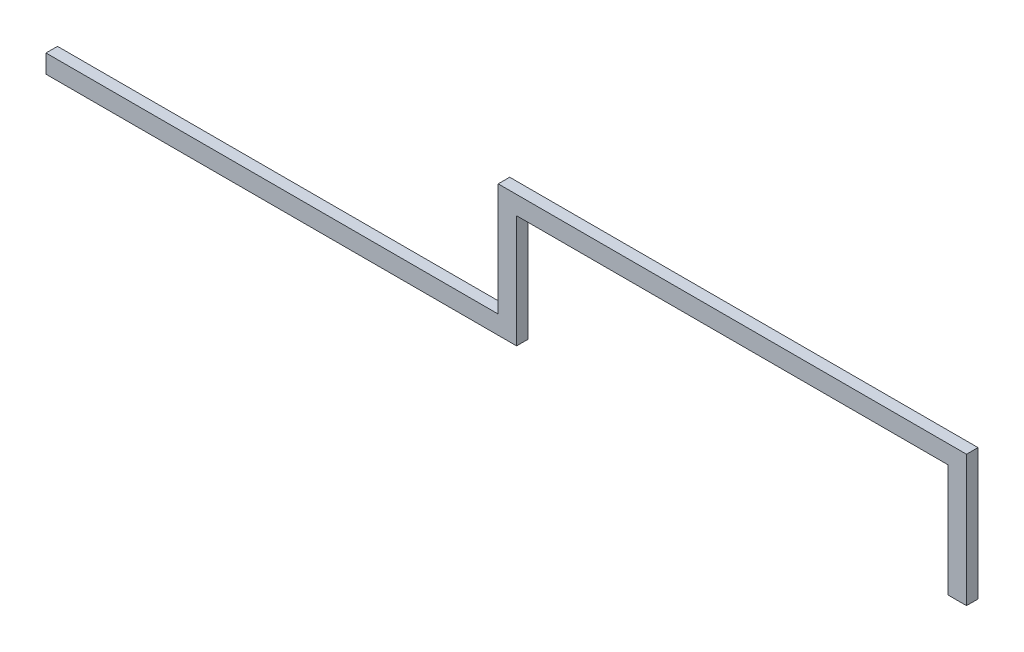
from build123d import *

# Parameters (mm, degrees)
SKIZZE1_W                       = 400
SKIZZE1_H                       = 57
LINEAR_AUSTRAGEN1_DEPTH         = 5
SKIZZE2_W                       = 196.495760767
SKIZZE2_H                       = 49
SKIZZE2_W_2                     = 187.504239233
SCHNITT_LINEAR_AUSTRAGEN1_DEPTH = 209.024037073


with BuildPart() as part:
    # Skizze1 → Linear austragen1 (new body)
    with BuildSketch(Plane.XY):
        with Locations((0, 28.5)):
            Rectangle(SKIZZE1_W, SKIZZE1_H)
    extrude(amount=LINEAR_AUSTRAGEN1_DEPTH)

    # Skizze2 → Schnitt-Linear austragen1 (cut, through all)
    with BuildSketch(Plane.XY.offset(5)):
        with Locations((-101.752119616, 32.5)):
            Rectangle(SKIZZE2_W, SKIZZE2_H)
        with Locations((98.247880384, 24.5)):
            Rectangle(SKIZZE2_W_2, SKIZZE2_H)
    extrude(amount=-SCHNITT_LINEAR_AUSTRAGEN1_DEPTH, mode=Mode.SUBTRACT)


solid = part.part
